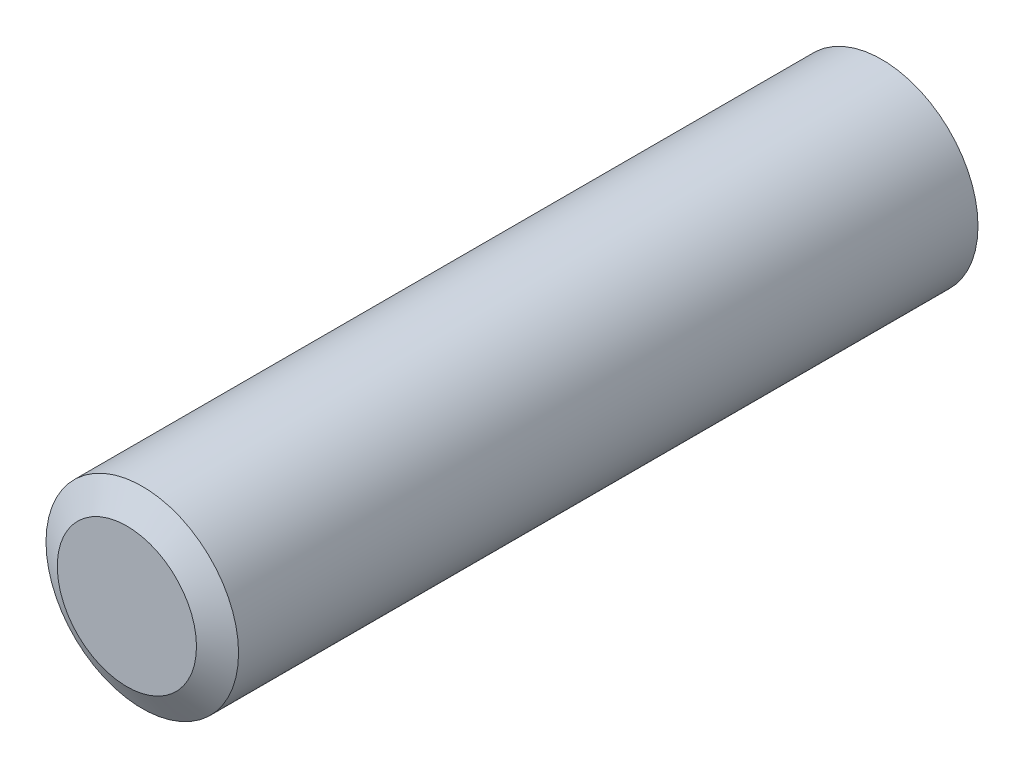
ISO-10303-21;
HEADER;
FILE_DESCRIPTION(('STEP AP214'),'2;1');
FILE_NAME('part.step','',(''),(''),'','','');
FILE_SCHEMA(('AUTOMOTIVE_DESIGN { 1 0 10303 214 1 1 1 1 }'));
ENDSEC;
DATA;
#1=APPLICATION_CONTEXT('core data for automotive mechanical design processes');
#2=APPLICATION_PROTOCOL_DEFINITION('international standard','automotive_design',2000,#1);
#3=PRODUCT_CONTEXT('',#1,'mechanical');
#4=PRODUCT('Part','Part','',(#3));
#5=PRODUCT_RELATED_PRODUCT_CATEGORY('part','',(#4));
#6=PRODUCT_DEFINITION_FORMATION('','',#4);
#7=PRODUCT_DEFINITION_CONTEXT('part definition',#1,'design');
#8=PRODUCT_DEFINITION('design','',#6,#7);
#9=PRODUCT_DEFINITION_SHAPE('','',#8);
#10=(LENGTH_UNIT() NAMED_UNIT(*) SI_UNIT(.MILLI.,.METRE.));
#11=(NAMED_UNIT(*) PLANE_ANGLE_UNIT() SI_UNIT($,.RADIAN.));
#12=(NAMED_UNIT(*) SI_UNIT($,.STERADIAN.) SOLID_ANGLE_UNIT());
#13=UNCERTAINTY_MEASURE_WITH_UNIT(LENGTH_MEASURE(1.E-05),#10,'distance_accuracy_value','');
#14=(GEOMETRIC_REPRESENTATION_CONTEXT(3) GLOBAL_UNCERTAINTY_ASSIGNED_CONTEXT((#13)) GLOBAL_UNIT_ASSIGNED_CONTEXT((#10,
#11,#12)) REPRESENTATION_CONTEXT('',''));
#15=CARTESIAN_POINT('',(0.,0.,0.));
#16=DIRECTION('',(0.,0.,1.));
#17=DIRECTION('',(1.,0.,0.));
#18=AXIS2_PLACEMENT_3D('',#15,#16,#17);
#19=CARTESIAN_POINT('',(0.,0.,12.7));
#20=DIRECTION('',(0.,0.,-1.));
#21=DIRECTION('',(-1.,0.,0.));
#22=AXIS2_PLACEMENT_3D('',#19,#20,#21);
#23=CYLINDRICAL_SURFACE('',#22,3.175);
#24=CARTESIAN_POINT('',(0.,0.,-12.192));
#25=DIRECTION('',(0.,0.,1.));
#26=DIRECTION('',(1.,0.,0.));
#27=AXIS2_PLACEMENT_3D('',#24,#25,#26);
#28=CIRCLE('',#27,3.175);
#29=CARTESIAN_POINT('',(3.175,0.,-12.192));
#30=VERTEX_POINT('',#29);
#31=EDGE_CURVE('E45',#30,#30,#28,.T.);
#32=ORIENTED_EDGE('',*,*,#31,.T.);
#33=EDGE_LOOP('',(#32));
#34=FACE_BOUND('',#33,.T.);
#35=CARTESIAN_POINT('',(0.,0.,12.192));
#36=DIRECTION('',(0.,0.,1.));
#37=DIRECTION('',(1.,0.,0.));
#38=AXIS2_PLACEMENT_3D('',#35,#36,#37);
#39=CIRCLE('',#38,3.175);
#40=CARTESIAN_POINT('',(3.175,0.,12.192));
#41=VERTEX_POINT('',#40);
#42=EDGE_CURVE('E49',#41,#41,#39,.F.);
#43=ORIENTED_EDGE('',*,*,#42,.T.);
#44=EDGE_LOOP('',(#43));
#45=FACE_BOUND('',#44,.T.);
#46=ADVANCED_FACE('F34',(#34,#45),#23,.T.);
#47=CARTESIAN_POINT('',(0.,0.,12.7));
#48=DIRECTION('',(0.,0.,1.));
#49=DIRECTION('',(1.,0.,0.));
#50=AXIS2_PLACEMENT_3D('',#47,#48,#49);
#51=PLANE('',#50);
#52=CARTESIAN_POINT('',(0.,0.,12.7));
#53=DIRECTION('',(0.,0.,1.));
#54=DIRECTION('',(1.,0.,0.));
#55=AXIS2_PLACEMENT_3D('',#52,#53,#54);
#56=CIRCLE('',#55,2.29511818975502);
#57=CARTESIAN_POINT('',(2.29511818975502,0.,12.7));
#58=VERTEX_POINT('',#57);
#59=EDGE_CURVE('E10',#58,#58,#56,.T.);
#60=ORIENTED_EDGE('',*,*,#59,.T.);
#61=EDGE_LOOP('',(#60));
#62=FACE_BOUND('',#61,.T.);
#63=ADVANCED_FACE('F65',(#62),#51,.T.);
#64=CARTESIAN_POINT('',(0.,0.,-12.7));
#65=DIRECTION('',(0.,0.,1.));
#66=DIRECTION('',(1.,0.,0.));
#67=AXIS2_PLACEMENT_3D('',#64,#65,#66);
#68=PLANE('',#67);
#69=CARTESIAN_POINT('',(0.,0.,-12.7));
#70=DIRECTION('',(0.,0.,1.));
#71=DIRECTION('',(1.,0.,0.));
#72=AXIS2_PLACEMENT_3D('',#69,#70,#71);
#73=CIRCLE('',#72,2.29511818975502);
#74=CARTESIAN_POINT('',(2.29511818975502,0.,-12.7));
#75=VERTEX_POINT('',#74);
#76=EDGE_CURVE('E41',#75,#75,#73,.F.);
#77=ORIENTED_EDGE('',*,*,#76,.T.);
#78=EDGE_LOOP('',(#77));
#79=FACE_BOUND('',#78,.T.);
#80=ADVANCED_FACE('F62',(#79),#68,.F.);
#81=CARTESIAN_POINT('',(0.,0.,-12.192));
#82=DIRECTION('',(0.,0.,1.));
#83=DIRECTION('',(1.,0.,0.));
#84=AXIS2_PLACEMENT_3D('',#81,#82,#83);
#85=CONICAL_SURFACE('',#84,3.175,1.04719755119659);
#86=ORIENTED_EDGE('',*,*,#76,.F.);
#87=EDGE_LOOP('',(#86));
#88=FACE_BOUND('',#87,.T.);
#89=ORIENTED_EDGE('',*,*,#31,.F.);
#90=EDGE_LOOP('',(#89));
#91=FACE_BOUND('',#90,.T.);
#92=ADVANCED_FACE('F58',(#88,#91),#85,.T.);
#93=CARTESIAN_POINT('',(0.,0.,12.7));
#94=DIRECTION('',(0.,0.,-1.));
#95=DIRECTION('',(-1.,0.,0.));
#96=AXIS2_PLACEMENT_3D('',#93,#94,#95);
#97=CONICAL_SURFACE('',#96,2.29511818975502,1.0471975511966);
#98=ORIENTED_EDGE('',*,*,#42,.F.);
#99=EDGE_LOOP('',(#98));
#100=FACE_BOUND('',#99,.T.);
#101=ORIENTED_EDGE('',*,*,#59,.F.);
#102=EDGE_LOOP('',(#101));
#103=FACE_BOUND('',#102,.T.);
#104=ADVANCED_FACE('F36',(#100,#103),#97,.T.);
#105=CLOSED_SHELL('',(#46,#63,#80,#92,#104));
#106=MANIFOLD_SOLID_BREP('B2',#105);
#107=ADVANCED_BREP_SHAPE_REPRESENTATION('',(#18,#106),#14);
#108=SHAPE_DEFINITION_REPRESENTATION(#9,#107);
ENDSEC;
END-ISO-10303-21;
